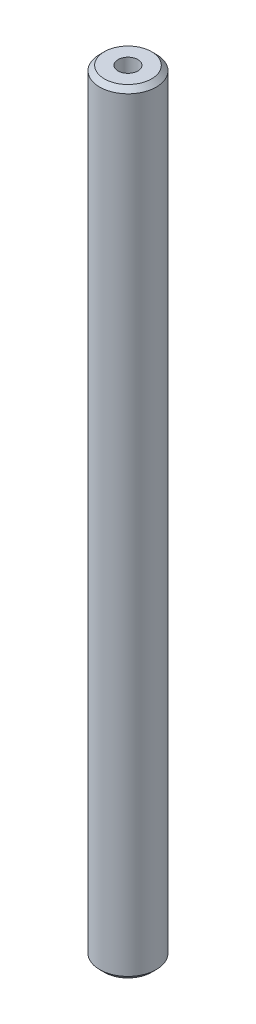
ISO-10303-21;
HEADER;
FILE_DESCRIPTION(('STEP AP214'),'2;1');
FILE_NAME('part.step','',(''),(''),'','','');
FILE_SCHEMA(('AUTOMOTIVE_DESIGN { 1 0 10303 214 1 1 1 1 }'));
ENDSEC;
DATA;
#1=APPLICATION_CONTEXT('core data for automotive mechanical design processes');
#2=APPLICATION_PROTOCOL_DEFINITION('international standard','automotive_design',2000,#1);
#3=PRODUCT_CONTEXT('',#1,'mechanical');
#4=PRODUCT('Part','Part','',(#3));
#5=PRODUCT_RELATED_PRODUCT_CATEGORY('part','',(#4));
#6=PRODUCT_DEFINITION_FORMATION('','',#4);
#7=PRODUCT_DEFINITION_CONTEXT('part definition',#1,'design');
#8=PRODUCT_DEFINITION('design','',#6,#7);
#9=PRODUCT_DEFINITION_SHAPE('','',#8);
#10=(LENGTH_UNIT() NAMED_UNIT(*) SI_UNIT(.MILLI.,.METRE.));
#11=(NAMED_UNIT(*) PLANE_ANGLE_UNIT() SI_UNIT($,.RADIAN.));
#12=(NAMED_UNIT(*) SI_UNIT($,.STERADIAN.) SOLID_ANGLE_UNIT());
#13=UNCERTAINTY_MEASURE_WITH_UNIT(LENGTH_MEASURE(1.E-05),#10,'distance_accuracy_value','');
#14=(GEOMETRIC_REPRESENTATION_CONTEXT(3) GLOBAL_UNCERTAINTY_ASSIGNED_CONTEXT((#13)) GLOBAL_UNIT_ASSIGNED_CONTEXT((#10,
#11,#12)) REPRESENTATION_CONTEXT('',''));
#15=CARTESIAN_POINT('',(0.,0.,0.));
#16=DIRECTION('',(0.,0.,1.));
#17=DIRECTION('',(1.,0.,0.));
#18=AXIS2_PLACEMENT_3D('',#15,#16,#17);
#19=CARTESIAN_POINT('',(0.,164.,0.));
#20=DIRECTION('',(0.,-1.,0.));
#21=DIRECTION('',(0.,0.,-1.));
#22=AXIS2_PLACEMENT_3D('',#19,#20,#21);
#23=CYLINDRICAL_SURFACE('',#22,6.);
#24=CARTESIAN_POINT('',(0.,1.,0.));
#25=DIRECTION('',(0.,1.,0.));
#26=DIRECTION('',(0.,0.,1.));
#27=AXIS2_PLACEMENT_3D('',#24,#25,#26);
#28=CIRCLE('',#27,6.);
#29=CARTESIAN_POINT('',(0.,1.,6.));
#30=VERTEX_POINT('',#29);
#31=EDGE_CURVE('E9210',#30,#30,#28,.T.);
#32=ORIENTED_EDGE('',*,*,#31,.T.);
#33=EDGE_LOOP('',(#32));
#34=FACE_BOUND('',#33,.T.);
#35=CARTESIAN_POINT('',(0.,163.,0.));
#36=DIRECTION('',(0.,1.,0.));
#37=DIRECTION('',(0.,0.,1.));
#38=AXIS2_PLACEMENT_3D('',#35,#36,#37);
#39=CIRCLE('',#38,6.);
#40=CARTESIAN_POINT('',(0.,163.,6.));
#41=VERTEX_POINT('',#40);
#42=EDGE_CURVE('E9207',#41,#41,#39,.F.);
#43=ORIENTED_EDGE('',*,*,#42,.T.);
#44=EDGE_LOOP('',(#43));
#45=FACE_BOUND('',#44,.T.);
#46=ADVANCED_FACE('F9174',(#34,#45),#23,.T.);
#47=CARTESIAN_POINT('',(0.,164.,0.));
#48=DIRECTION('',(0.,1.,0.));
#49=DIRECTION('',(0.,0.,1.));
#50=AXIS2_PLACEMENT_3D('',#47,#48,#49);
#51=PLANE('',#50);
#52=CARTESIAN_POINT('',(0.,164.,0.));
#53=DIRECTION('',(0.,1.,0.));
#54=DIRECTION('',(0.,0.,1.));
#55=AXIS2_PLACEMENT_3D('',#52,#53,#54);
#56=CIRCLE('',#55,2.09999999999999);
#57=CARTESIAN_POINT('',(0.,164.,2.09999999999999));
#58=VERTEX_POINT('',#57);
#59=EDGE_CURVE('E9204',#58,#58,#56,.T.);
#60=ORIENTED_EDGE('',*,*,#59,.F.);
#61=EDGE_LOOP('',(#60));
#62=FACE_BOUND('',#61,.T.);
#63=CARTESIAN_POINT('',(0.,164.,0.));
#64=DIRECTION('',(0.,1.,0.));
#65=DIRECTION('',(0.,0.,1.));
#66=AXIS2_PLACEMENT_3D('',#63,#64,#65);
#67=CIRCLE('',#66,5.);
#68=CARTESIAN_POINT('',(0.,164.,5.));
#69=VERTEX_POINT('',#68);
#70=EDGE_CURVE('E11',#69,#69,#67,.T.);
#71=ORIENTED_EDGE('',*,*,#70,.T.);
#72=EDGE_LOOP('',(#71));
#73=FACE_BOUND('',#72,.T.);
#74=ADVANCED_FACE('F9226',(#62,#73),#51,.T.);
#75=CARTESIAN_POINT('',(0.,0.,0.));
#76=DIRECTION('',(0.,1.,0.));
#77=DIRECTION('',(0.,0.,1.));
#78=AXIS2_PLACEMENT_3D('',#75,#76,#77);
#79=PLANE('',#78);
#80=CARTESIAN_POINT('',(0.,0.,0.));
#81=DIRECTION('',(0.,-1.,0.));
#82=DIRECTION('',(0.,0.,-1.));
#83=AXIS2_PLACEMENT_3D('',#80,#81,#82);
#84=CIRCLE('',#83,2.09999999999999);
#85=CARTESIAN_POINT('',(0.,0.,-2.09999999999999));
#86=VERTEX_POINT('',#85);
#87=EDGE_CURVE('E9196',#86,#86,#84,.T.);
#88=ORIENTED_EDGE('',*,*,#87,.F.);
#89=EDGE_LOOP('',(#88));
#90=FACE_BOUND('',#89,.T.);
#91=CARTESIAN_POINT('',(0.,0.,0.));
#92=DIRECTION('',(0.,1.,0.));
#93=DIRECTION('',(0.,0.,1.));
#94=AXIS2_PLACEMENT_3D('',#91,#92,#93);
#95=CIRCLE('',#94,4.99999999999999);
#96=CARTESIAN_POINT('',(0.,0.,4.99999999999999));
#97=VERTEX_POINT('',#96);
#98=EDGE_CURVE('E9181',#97,#97,#95,.F.);
#99=ORIENTED_EDGE('',*,*,#98,.T.);
#100=EDGE_LOOP('',(#99));
#101=FACE_BOUND('',#100,.T.);
#102=ADVANCED_FACE('F9215',(#90,#101),#79,.F.);
#103=CARTESIAN_POINT('',(0.,1.,0.));
#104=DIRECTION('',(0.,1.,0.));
#105=DIRECTION('',(0.,0.,1.));
#106=AXIS2_PLACEMENT_3D('',#103,#104,#105);
#107=CONICAL_SURFACE('',#106,6.,0.785398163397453);
#108=ORIENTED_EDGE('',*,*,#98,.F.);
#109=EDGE_LOOP('',(#108));
#110=FACE_BOUND('',#109,.T.);
#111=ORIENTED_EDGE('',*,*,#31,.F.);
#112=EDGE_LOOP('',(#111));
#113=FACE_BOUND('',#112,.T.);
#114=ADVANCED_FACE('F9217',(#110,#113),#107,.T.);
#115=CARTESIAN_POINT('',(0.,164.,0.));
#116=DIRECTION('',(0.,-1.,0.));
#117=DIRECTION('',(0.,0.,-1.));
#118=AXIS2_PLACEMENT_3D('',#115,#116,#117);
#119=CONICAL_SURFACE('',#118,5.,0.785398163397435);
#120=ORIENTED_EDGE('',*,*,#42,.F.);
#121=EDGE_LOOP('',(#120));
#122=FACE_BOUND('',#121,.T.);
#123=ORIENTED_EDGE('',*,*,#70,.F.);
#124=EDGE_LOOP('',(#123));
#125=FACE_BOUND('',#124,.T.);
#126=ADVANCED_FACE('F9220',(#122,#125),#119,.T.);
#127=CARTESIAN_POINT('',(0.,164.,0.));
#128=DIRECTION('',(0.,1.,0.));
#129=DIRECTION('',(0.,0.,1.));
#130=AXIS2_PLACEMENT_3D('',#127,#128,#129);
#131=CYLINDRICAL_SURFACE('',#130,2.09999999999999);
#132=CARTESIAN_POINT('',(0.,151.6,0.));
#133=DIRECTION('',(0.,1.,0.));
#134=DIRECTION('',(0.,0.,1.));
#135=AXIS2_PLACEMENT_3D('',#132,#133,#134);
#136=CIRCLE('',#135,2.09999999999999);
#137=CARTESIAN_POINT('',(0.,151.6,2.09999999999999));
#138=VERTEX_POINT('',#137);
#139=EDGE_CURVE('E9199',#138,#138,#136,.T.);
#140=ORIENTED_EDGE('',*,*,#139,.F.);
#141=EDGE_LOOP('',(#140));
#142=FACE_BOUND('',#141,.T.);
#143=ORIENTED_EDGE('',*,*,#59,.T.);
#144=EDGE_LOOP('',(#143));
#145=FACE_BOUND('',#144,.T.);
#146=ADVANCED_FACE('F9231',(#142,#145),#131,.F.);
#147=CARTESIAN_POINT('',(0.,151.6,0.));
#148=DIRECTION('',(0.,1.,0.));
#149=DIRECTION('',(0.,0.,1.));
#150=AXIS2_PLACEMENT_3D('',#147,#148,#149);
#151=CONICAL_SURFACE('',#150,2.09999999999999,1.02974425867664);
#152=CARTESIAN_POINT('',(0.,150.338192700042,0.));
#153=VERTEX_POINT('',#152);
#154=VERTEX_LOOP('',#153);
#155=FACE_BOUND('',#154,.T.);
#156=ORIENTED_EDGE('',*,*,#139,.T.);
#157=EDGE_LOOP('',(#156));
#158=FACE_BOUND('',#157,.T.);
#159=ADVANCED_FACE('F9247',(#155,#158),#151,.F.);
#160=CARTESIAN_POINT('',(0.,0.,0.));
#161=DIRECTION('',(0.,-1.,0.));
#162=DIRECTION('',(0.,0.,-1.));
#163=AXIS2_PLACEMENT_3D('',#160,#161,#162);
#164=CYLINDRICAL_SURFACE('',#163,2.09999999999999);
#165=CARTESIAN_POINT('',(0.,12.4,0.));
#166=DIRECTION('',(0.,-1.,0.));
#167=DIRECTION('',(0.,0.,-1.));
#168=AXIS2_PLACEMENT_3D('',#165,#166,#167);
#169=CIRCLE('',#168,2.09999999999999);
#170=CARTESIAN_POINT('',(0.,12.4,-2.09999999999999));
#171=VERTEX_POINT('',#170);
#172=EDGE_CURVE('E9194',#171,#171,#169,.T.);
#173=ORIENTED_EDGE('',*,*,#172,.F.);
#174=EDGE_LOOP('',(#173));
#175=FACE_BOUND('',#174,.T.);
#176=ORIENTED_EDGE('',*,*,#87,.T.);
#177=EDGE_LOOP('',(#176));
#178=FACE_BOUND('',#177,.T.);
#179=ADVANCED_FACE('F9190',(#175,#178),#164,.F.);
#180=CARTESIAN_POINT('',(0.,12.4,0.));
#181=DIRECTION('',(0.,-1.,0.));
#182=DIRECTION('',(0.,0.,-1.));
#183=AXIS2_PLACEMENT_3D('',#180,#181,#182);
#184=CONICAL_SURFACE('',#183,2.09999999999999,1.02974425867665);
#185=CARTESIAN_POINT('',(0.,13.6618072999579,0.));
#186=VERTEX_POINT('',#185);
#187=VERTEX_LOOP('',#186);
#188=FACE_BOUND('',#187,.T.);
#189=ORIENTED_EDGE('',*,*,#172,.T.);
#190=EDGE_LOOP('',(#189));
#191=FACE_BOUND('',#190,.T.);
#192=ADVANCED_FACE('F9187',(#188,#191),#184,.F.);
#193=CLOSED_SHELL('',(#46,#74,#102,#114,#126,#146,#159,#179,#192));
#194=MANIFOLD_SOLID_BREP('B2',#193);
#195=ADVANCED_BREP_SHAPE_REPRESENTATION('',(#18,#194),#14);
#196=SHAPE_DEFINITION_REPRESENTATION(#9,#195);
ENDSEC;
END-ISO-10303-21;
